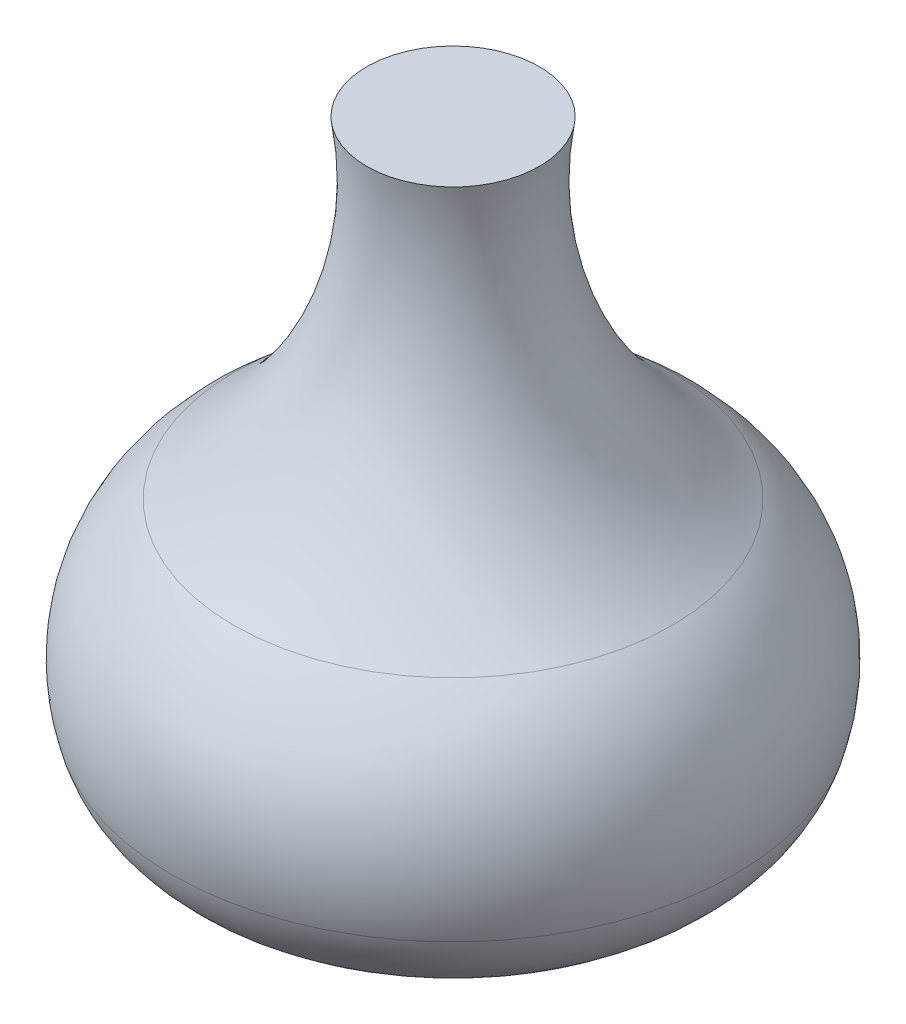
from build123d import *


with BuildPart() as part:
    # Sketch 1 → Revolve 1 (revolve)
    with BuildSketch(Plane.XY, mode=Mode.PRIVATE) as revolve_1_sk:
        with BuildLine():
            Line((0, 53.041176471), (-15, 53.041176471))
            ThreePointArc((-15, 53.041176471), (-14.486596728, 37.755427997), (-17.854527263, 22.836489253))
            ThreePointArc((-17.854527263, 22.836489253), (-25.98757103, 7.713237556), (-38.071142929, -4.487026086))
            ThreePointArc((-38.071142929, -4.487026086), (-48.430790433, -18.865770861), (-48.867798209, -36.582419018))
            ThreePointArc((-48.867798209, -36.582419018), (-44.419590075, -44.600924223), (-36.860453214, -49.79153413))
            Line((-36.860453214, -49.79153413), (0, -49.79153413))
            Line((0, -49.79153413), (0, 53.041176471))
        make_face()
    revolve(revolve_1_sk.sketch.rotate(Axis((0, 76.947058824, 0), (0, -1, 0)), 270), axis=Axis((0, 76.947058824, 0), (0, -1, 0)))


solid = part.part
